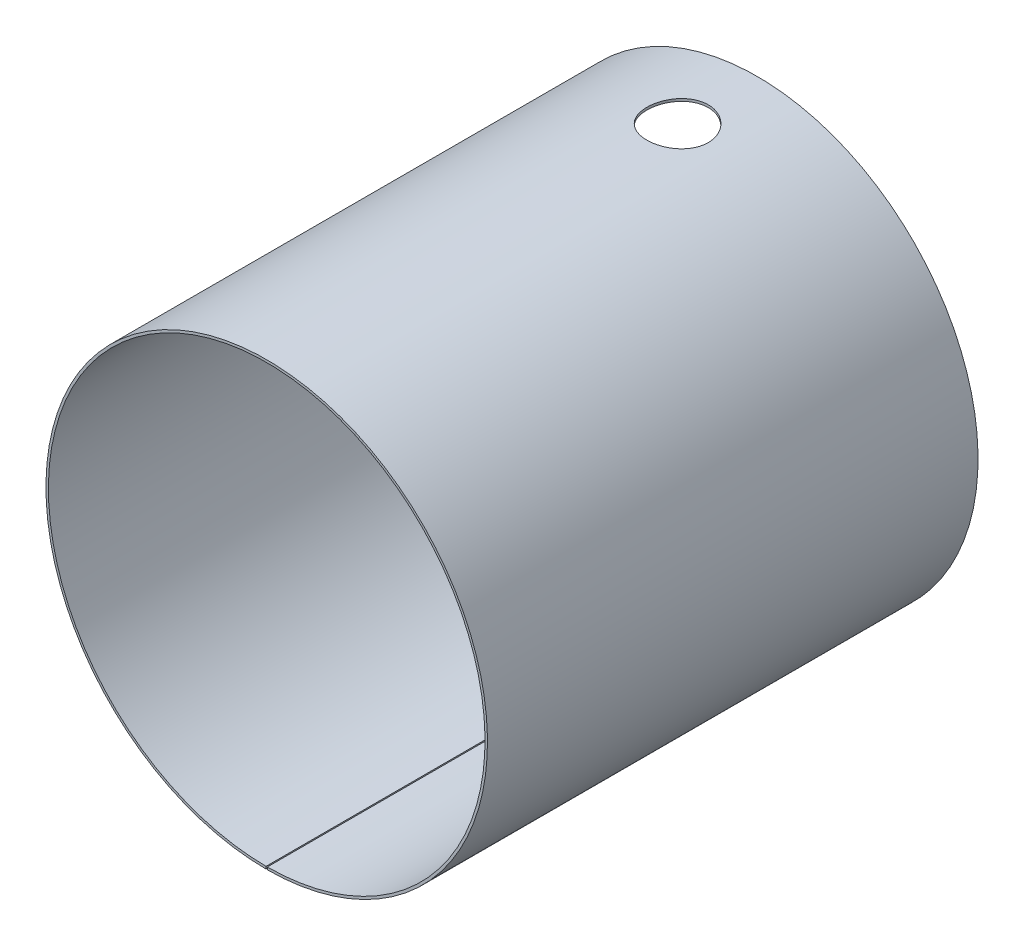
from build123d import *

# Parameters (mm, degrees)
ESQUISSE1_R             = 180
ESQUISSE1_R_2           = 178
EXTRU_MINCE1_DEPTH      = 400
ESQUISSE4_R             = 25
ENL_V_MAT_EXTRU_1_DEPTH = 271
ESQUISSE5_W             = 1
ESQUISSE5_H             = 427.679873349
ENL_V_MAT_EXTRU_2_DEPTH = 475.130783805


with BuildPart() as part:
    # Esquisse1 → Extru.-Mince1 (new body)
    with BuildSketch(Plane.XY):
        Circle(ESQUISSE1_R)
        Circle(ESQUISSE1_R_2, mode=Mode.SUBTRACT)
    extrude(amount=EXTRU_MINCE1_DEPTH)

    # Esquisse4 → Enl_v. mat.-Extru.1 (cut)
    with BuildSketch(Plane(origin=(0, 0, 0), x_dir=(1, 0, 0), z_dir=(0, 1, 0))):
        with Locations(Location((0, -65, 0), (0, 0, 90))):
            Circle(ESQUISSE4_R)
    extrude(amount=ENL_V_MAT_EXTRU_1_DEPTH, mode=Mode.SUBTRACT)

    # Esquisse5 → Enl_v. mat.-Extru.2 (cut, through all)
    with BuildSketch(Plane(origin=(0, 0, 0), x_dir=(1, 0, 0), z_dir=(0, 1, 0))):
        with Locations((0, -203.466233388)):
            Rectangle(ESQUISSE5_W, ESQUISSE5_H)
    extrude(amount=-ENL_V_MAT_EXTRU_2_DEPTH, mode=Mode.SUBTRACT)


solid = part.part
